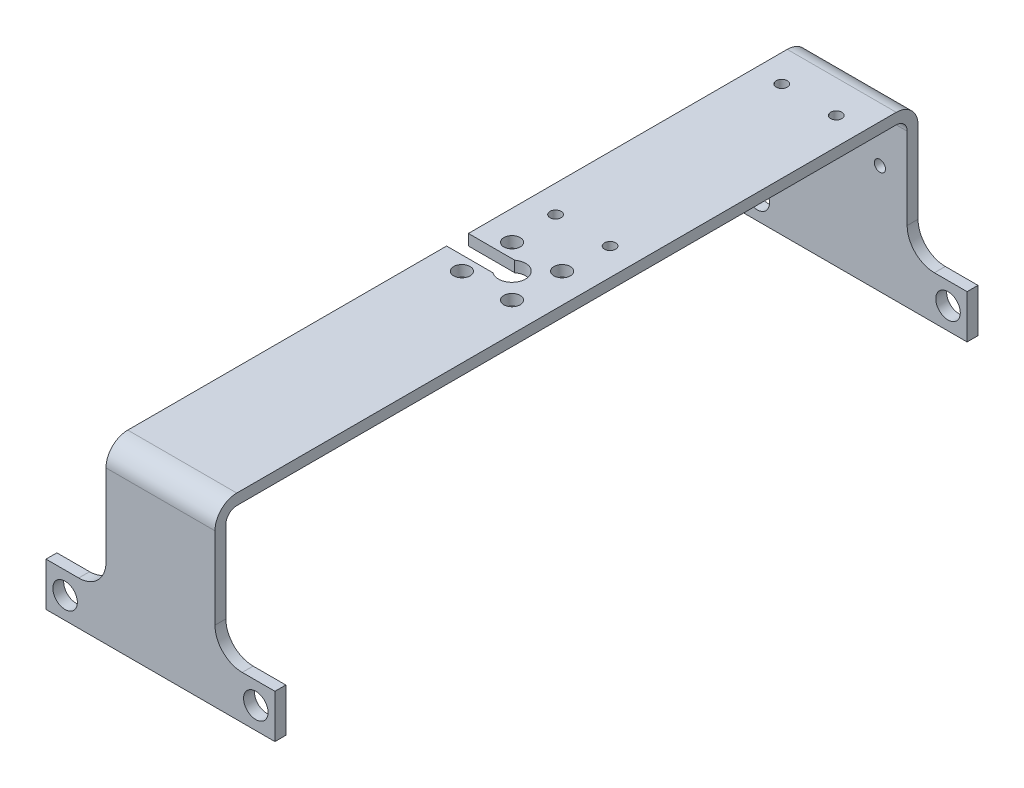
from build123d import *

# Parameters (mm, degrees)
EXTRUDE_1_DEPTH          = 20
SKETCH_5_R               = 2.5
CUT_EXTRUDE_3_DEPTH      = 81.847077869
HOLE_WIZARD_3_0_3_1_D    = 3
PATTERN_CIRCULAR_1_COUNT = 4
HOLE_WIZARD_M2_51_D      = 2.05
HOLE_WIZARD_M2_52_D      = 2.05
EXTRUDE_3_DEPTH          = 20
SKETCH_17_W              = 8.5
SKETCH_17_H              = 4
CUT_EXTRUDE_6_DEPTH      = 135.406101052
SKETCH_19_W              = 11
SKETCH_19_H              = 8
EXTRUDE_4_DEPTH          = 2
SKETCH_20_W              = 11
SKETCH_20_H              = 8
EXTRUDE_6_DEPTH          = 2
SKETCH_21_R              = 2.25
CUT_EXTRUDE_8_DEPTH      = 137.477104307
FILLET_1_R               = 5


with BuildPart() as part:
    # Sketch 1 → Extrude 1 (new body)
    with BuildSketch(Plane(origin=(0, 0, 0), x_dir=(0, 0, -1), z_dir=(1, 0, 0))):
        with BuildLine():
            Line((-2, 0), (0, 0))
            Line((0, 0), (0, 28))
            ThreePointArc((0, 28), (-1.171572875, 30.828427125), (-4, 32))
            Line((-4, 32), (-71.5, 32))
            Line((-71.5, 32), (-71.5, 30))
            Line((-71.5, 30), (-4, 30))
            ThreePointArc((-4, 30), (-2.585786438, 29.414213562), (-2, 28))
            Line((-2, 28), (-2, 0))
        make_face()
    extrude(amount=EXTRUDE_1_DEPTH)

    # Sketch 5 → Cut-Extrude 3 (cut, through all)
    with BuildSketch(Plane(origin=(0, 32, 0), x_dir=(1, 0, 0), z_dir=(0, 1, 0))):
        with Locations(Location((10, -64.5, 0), (0, 0, 270))):
            Circle(SKETCH_5_R)
    extrude(amount=-CUT_EXTRUDE_3_DEPTH, mode=Mode.SUBTRACT)

    # Hole Wizard 3.0 _3_1 (through all)
    with Locations(Plane(origin=(0, 32, 0), x_dir=(-1, 0, 0), z_dir=(0, 1, 0))):
        with Locations((-5.403805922, 59.903805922)):
            hole_wizard_3_0_3_1 = Hole(HOLE_WIZARD_3_0_3_1_D / 2)

    # Pattern Circular 1: Hole Wizard 3.0 _3_1 ×4 about axis
    pattern_circular_1_axis = Axis((10, 0, 64.5), (0, 1, 0))
    for i in range(1, PATTERN_CIRCULAR_1_COUNT):
        add(hole_wizard_3_0_3_1.rotate(pattern_circular_1_axis, i * 360 / PATTERN_CIRCULAR_1_COUNT), mode=Mode.SUBTRACT)

    # Hole Wizard M2.51 (through all)
    with Locations(Plane(origin=(0, 32, 0), x_dir=(-1, 0, 0), z_dir=(0, 1, 0))):
        with Locations((-15, 51.5), (-5, 51.5), (-15, 10), (-5, 10)):
            Hole(HOLE_WIZARD_M2_51_D / 2)

    # Hole Wizard M2.52 (through all)
    with Locations(Plane(origin=(0, 0, 0), x_dir=(-1, 0, 0), z_dir=(0, 0, -1))):
        with Locations((-15, 20), (-5, 20)):
            Hole(HOLE_WIZARD_M2_52_D / 2)

    # Sketch 16 → Extrude 3 (add)
    with BuildSketch(Plane.ZY):
        with BuildLine():
            Line((71.5, 32), (125, 32))
            ThreePointArc((125, 32), (127.828427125, 30.828427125), (129, 28))
            Line((129, 28), (129, 0))
            Line((129, 0), (127, 0))
            Line((127, 0), (127, 28))
            ThreePointArc((127, 28), (126.414213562, 29.414213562), (125, 30))
            Line((125, 30), (71.5, 30))
            Line((71.5, 30), (71.5, 32))
        make_face()
    extrude(amount=-EXTRUDE_3_DEPTH)

    # Sketch 17 → Cut-Extrude 6 (cut, through all)
    with BuildSketch(Plane(origin=(0, 32, 0), x_dir=(1, 0, 0), z_dir=(0, 1, 0))):
        with Locations((4.25, -64.5)):
            Rectangle(SKETCH_17_W, SKETCH_17_H)
    extrude(amount=-CUT_EXTRUDE_6_DEPTH, mode=Mode.SUBTRACT)

    # Sketch 19 → Extrude 4 (add)
    with BuildSketch(Plane.XY):
        with Locations((-5.5, 4)):
            Rectangle(SKETCH_19_W, SKETCH_19_H)
        with Locations((25.5, 4)):
            Rectangle(SKETCH_19_W, SKETCH_19_H)
    extrude(amount=EXTRUDE_4_DEPTH)

    # Sketch 20 → Extrude 6 (add)
    with BuildSketch(Plane.XY.offset(129)):
        with Locations((-5.5, 4)):
            Rectangle(SKETCH_20_W, SKETCH_20_H)
        with Locations((25.5, 4)):
            Rectangle(SKETCH_20_W, SKETCH_20_H)
    extrude(amount=-EXTRUDE_6_DEPTH)

    # Sketch 21 → Cut-Extrude 8 (cut, through all)
    with BuildSketch(Plane(origin=(0, 0, 0), x_dir=(-1, 0, 0), z_dir=(0, 0, -1))):
        with Locations((-27.5, 4)):
            Circle(SKETCH_21_R)
        with Locations(Location((7.5, 4, 0), (0, 0, 90))):
            Circle(SKETCH_21_R)
    extrude(amount=-CUT_EXTRUDE_8_DEPTH, mode=Mode.SUBTRACT)

    # Fillet 1
    fillet_1_edges = [part.edges().sort_by_distance(p)[0] for p in [
        (0, 8, 1),
        (20, 8, 1),
        (0, 8, 128),
        (20, 8, 128),
    ]]
    fillet(fillet_1_edges, radius=FILLET_1_R)


solid = part.part
